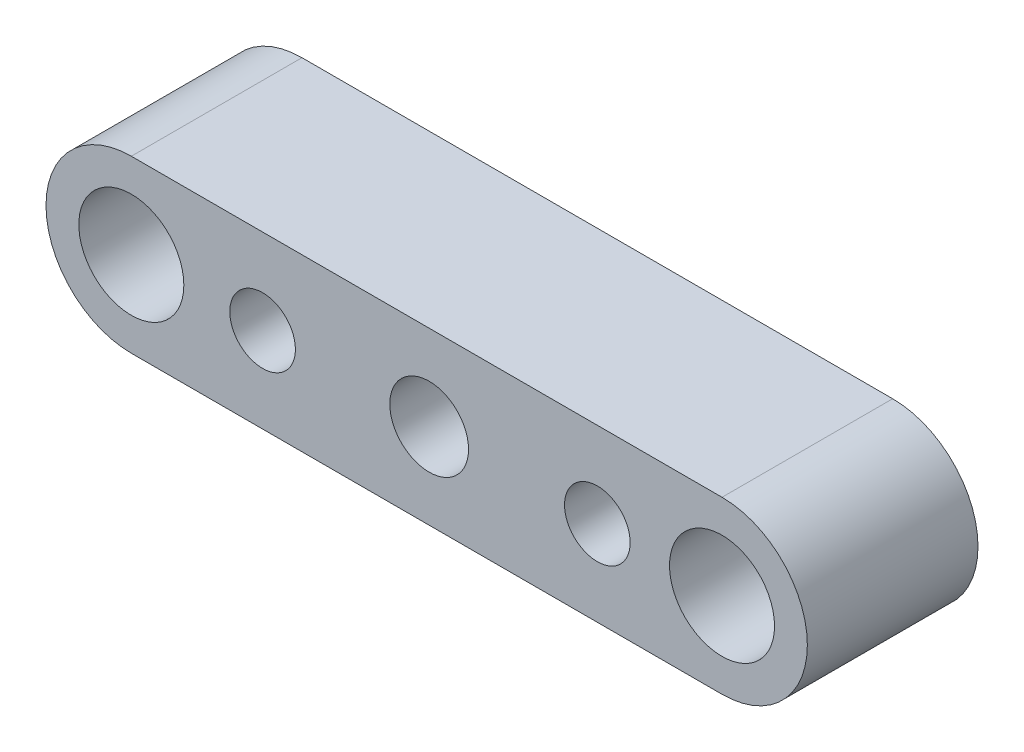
ISO-10303-21;
HEADER;
FILE_DESCRIPTION(('STEP AP214'),'2;1');
FILE_NAME('part.step','',(''),(''),'','','');
FILE_SCHEMA(('AUTOMOTIVE_DESIGN { 1 0 10303 214 1 1 1 1 }'));
ENDSEC;
DATA;
#1=APPLICATION_CONTEXT('core data for automotive mechanical design processes');
#2=APPLICATION_PROTOCOL_DEFINITION('international standard','automotive_design',2000,#1);
#3=PRODUCT_CONTEXT('',#1,'mechanical');
#4=PRODUCT('Part','Part','',(#3));
#5=PRODUCT_RELATED_PRODUCT_CATEGORY('part','',(#4));
#6=PRODUCT_DEFINITION_FORMATION('','',#4);
#7=PRODUCT_DEFINITION_CONTEXT('part definition',#1,'design');
#8=PRODUCT_DEFINITION('design','',#6,#7);
#9=PRODUCT_DEFINITION_SHAPE('','',#8);
#10=(LENGTH_UNIT() NAMED_UNIT(*) SI_UNIT(.MILLI.,.METRE.));
#11=(NAMED_UNIT(*) PLANE_ANGLE_UNIT() SI_UNIT($,.RADIAN.));
#12=(NAMED_UNIT(*) SI_UNIT($,.STERADIAN.) SOLID_ANGLE_UNIT());
#13=UNCERTAINTY_MEASURE_WITH_UNIT(LENGTH_MEASURE(1.E-05),#10,'distance_accuracy_value','');
#14=(GEOMETRIC_REPRESENTATION_CONTEXT(3) GLOBAL_UNCERTAINTY_ASSIGNED_CONTEXT((#13)) GLOBAL_UNIT_ASSIGNED_CONTEXT((#10,
#11,#12)) REPRESENTATION_CONTEXT('',''));
#15=CARTESIAN_POINT('',(0.,0.,0.));
#16=DIRECTION('',(0.,0.,1.));
#17=DIRECTION('',(1.,0.,0.));
#18=AXIS2_PLACEMENT_3D('',#15,#16,#17);
#19=CARTESIAN_POINT('',(0.,0.,13.));
#20=DIRECTION('',(0.,0.,-1.));
#21=DIRECTION('',(-1.,0.,0.));
#22=AXIS2_PLACEMENT_3D('',#19,#20,#21);
#23=CYLINDRICAL_SURFACE('',#22,6.5);
#24=CARTESIAN_POINT('',(0.,0.,0.));
#25=DIRECTION('',(0.,0.,1.));
#26=DIRECTION('',(1.,0.,0.));
#27=AXIS2_PLACEMENT_3D('',#24,#25,#26);
#28=CIRCLE('',#27,6.5);
#29=CARTESIAN_POINT('',(0.,6.5,0.));
#30=VERTEX_POINT('',#29);
#31=CARTESIAN_POINT('',(0.,-6.5,0.));
#32=VERTEX_POINT('',#31);
#33=EDGE_CURVE('E97',#30,#32,#28,.T.);
#34=ORIENTED_EDGE('',*,*,#33,.T.);
#35=DIRECTION('',(0.,0.,-1.));
#36=VECTOR('',#35,1.);
#37=CARTESIAN_POINT('',(0.,-6.5,13.));
#38=LINE('',#37,#36);
#39=CARTESIAN_POINT('',(0.,-6.5,13.));
#40=VERTEX_POINT('',#39);
#41=EDGE_CURVE('E11',#40,#32,#38,.T.);
#42=ORIENTED_EDGE('',*,*,#41,.F.);
#43=CARTESIAN_POINT('',(0.,0.,13.));
#44=DIRECTION('',(0.,0.,1.));
#45=DIRECTION('',(1.,0.,0.));
#46=AXIS2_PLACEMENT_3D('',#43,#44,#45);
#47=CIRCLE('',#46,6.5);
#48=CARTESIAN_POINT('',(0.,6.5,13.));
#49=VERTEX_POINT('',#48);
#50=EDGE_CURVE('E85',#49,#40,#47,.T.);
#51=ORIENTED_EDGE('',*,*,#50,.F.);
#52=DIRECTION('',(0.,0.,-1.));
#53=VECTOR('',#52,1.);
#54=CARTESIAN_POINT('',(0.,6.5,13.));
#55=LINE('',#54,#53);
#56=EDGE_CURVE('E93',#49,#30,#55,.T.);
#57=ORIENTED_EDGE('',*,*,#56,.T.);
#58=EDGE_LOOP('',(#34,#42,#51,#57));
#59=FACE_BOUND('',#58,.T.);
#60=ADVANCED_FACE('F34',(#59),#23,.T.);
#61=CARTESIAN_POINT('',(0.,-6.5,13.));
#62=DIRECTION('',(0.,1.,0.));
#63=DIRECTION('',(0.,0.,1.));
#64=AXIS2_PLACEMENT_3D('',#61,#62,#63);
#65=PLANE('',#64);
#66=DIRECTION('',(1.,0.,0.));
#67=VECTOR('',#66,1.);
#68=CARTESIAN_POINT('',(0.,-6.5,0.));
#69=LINE('',#68,#67);
#70=CARTESIAN_POINT('',(45.,-6.5,0.));
#71=VERTEX_POINT('',#70);
#72=EDGE_CURVE('E89',#32,#71,#69,.T.);
#73=ORIENTED_EDGE('',*,*,#72,.T.);
#74=DIRECTION('',(0.,0.,-1.));
#75=VECTOR('',#74,1.);
#76=CARTESIAN_POINT('',(45.,-6.5,13.));
#77=LINE('',#76,#75);
#78=CARTESIAN_POINT('',(45.,-6.5,13.));
#79=VERTEX_POINT('',#78);
#80=EDGE_CURVE('E42',#79,#71,#77,.T.);
#81=ORIENTED_EDGE('',*,*,#80,.F.);
#82=DIRECTION('',(1.,0.,0.));
#83=VECTOR('',#82,1.);
#84=CARTESIAN_POINT('',(0.,-6.5,13.));
#85=LINE('',#84,#83);
#86=EDGE_CURVE('E80',#40,#79,#85,.T.);
#87=ORIENTED_EDGE('',*,*,#86,.F.);
#88=ORIENTED_EDGE('',*,*,#41,.T.);
#89=EDGE_LOOP('',(#73,#81,#87,#88));
#90=FACE_BOUND('',#89,.T.);
#91=ADVANCED_FACE('F88',(#90),#65,.F.);
#92=CARTESIAN_POINT('',(45.,0.,13.));
#93=DIRECTION('',(0.,0.,-1.));
#94=DIRECTION('',(-1.,0.,0.));
#95=AXIS2_PLACEMENT_3D('',#92,#93,#94);
#96=CYLINDRICAL_SURFACE('',#95,6.5);
#97=CARTESIAN_POINT('',(45.,0.,0.));
#98=DIRECTION('',(0.,0.,1.));
#99=DIRECTION('',(1.,0.,0.));
#100=AXIS2_PLACEMENT_3D('',#97,#98,#99);
#101=CIRCLE('',#100,6.5);
#102=CARTESIAN_POINT('',(45.,6.5,0.));
#103=VERTEX_POINT('',#102);
#104=EDGE_CURVE('E67',#71,#103,#101,.T.);
#105=ORIENTED_EDGE('',*,*,#104,.T.);
#106=DIRECTION('',(0.,0.,-1.));
#107=VECTOR('',#106,1.);
#108=CARTESIAN_POINT('',(45.,6.5,13.));
#109=LINE('',#108,#107);
#110=CARTESIAN_POINT('',(45.,6.5,13.));
#111=VERTEX_POINT('',#110);
#112=EDGE_CURVE('E90',#111,#103,#109,.T.);
#113=ORIENTED_EDGE('',*,*,#112,.F.);
#114=CARTESIAN_POINT('',(45.,0.,13.));
#115=DIRECTION('',(0.,0.,1.));
#116=DIRECTION('',(1.,0.,0.));
#117=AXIS2_PLACEMENT_3D('',#114,#115,#116);
#118=CIRCLE('',#117,6.5);
#119=EDGE_CURVE('E83',#79,#111,#118,.T.);
#120=ORIENTED_EDGE('',*,*,#119,.F.);
#121=ORIENTED_EDGE('',*,*,#80,.T.);
#122=EDGE_LOOP('',(#105,#113,#120,#121));
#123=FACE_BOUND('',#122,.T.);
#124=ADVANCED_FACE('F91',(#123),#96,.T.);
#125=CARTESIAN_POINT('',(0.,6.5,13.));
#126=DIRECTION('',(0.,-1.,0.));
#127=DIRECTION('',(0.,0.,-1.));
#128=AXIS2_PLACEMENT_3D('',#125,#126,#127);
#129=PLANE('',#128);
#130=DIRECTION('',(-1.,0.,0.));
#131=VECTOR('',#130,1.);
#132=CARTESIAN_POINT('',(0.,6.5,0.));
#133=LINE('',#132,#131);
#134=EDGE_CURVE('E73',#103,#30,#133,.T.);
#135=ORIENTED_EDGE('',*,*,#134,.T.);
#136=ORIENTED_EDGE('',*,*,#56,.F.);
#137=DIRECTION('',(-1.,0.,0.));
#138=VECTOR('',#137,1.);
#139=CARTESIAN_POINT('',(0.,6.5,13.));
#140=LINE('',#139,#138);
#141=EDGE_CURVE('E50',#111,#49,#140,.T.);
#142=ORIENTED_EDGE('',*,*,#141,.F.);
#143=ORIENTED_EDGE('',*,*,#112,.T.);
#144=EDGE_LOOP('',(#135,#136,#142,#143));
#145=FACE_BOUND('',#144,.T.);
#146=ADVANCED_FACE('F105',(#145),#129,.F.);
#147=CARTESIAN_POINT('',(0.,0.,13.));
#148=DIRECTION('',(0.,0.,1.));
#149=DIRECTION('',(1.,0.,0.));
#150=AXIS2_PLACEMENT_3D('',#147,#148,#149);
#151=PLANE('',#150);
#152=CARTESIAN_POINT('',(0.,0.,13.));
#153=DIRECTION('',(0.,0.,1.));
#154=DIRECTION('',(1.,0.,0.));
#155=AXIS2_PLACEMENT_3D('',#152,#153,#154);
#156=CIRCLE('',#155,4.);
#157=CARTESIAN_POINT('',(4.,0.,13.));
#158=VERTEX_POINT('',#157);
#159=EDGE_CURVE('E135',#158,#158,#156,.T.);
#160=ORIENTED_EDGE('',*,*,#159,.F.);
#161=EDGE_LOOP('',(#160));
#162=FACE_BOUND('',#161,.T.);
#163=CARTESIAN_POINT('',(45.,0.,13.));
#164=DIRECTION('',(0.,0.,1.));
#165=DIRECTION('',(1.,0.,0.));
#166=AXIS2_PLACEMENT_3D('',#163,#164,#165);
#167=CIRCLE('',#166,4.);
#168=CARTESIAN_POINT('',(49.,0.,13.));
#169=VERTEX_POINT('',#168);
#170=EDGE_CURVE('E129',#169,#169,#167,.T.);
#171=ORIENTED_EDGE('',*,*,#170,.F.);
#172=EDGE_LOOP('',(#171));
#173=FACE_BOUND('',#172,.T.);
#174=CARTESIAN_POINT('',(10.,0.,13.));
#175=DIRECTION('',(0.,0.,1.));
#176=DIRECTION('',(1.,0.,0.));
#177=AXIS2_PLACEMENT_3D('',#174,#175,#176);
#178=CIRCLE('',#177,2.5);
#179=CARTESIAN_POINT('',(12.5,0.,13.));
#180=VERTEX_POINT('',#179);
#181=EDGE_CURVE('E124',#180,#180,#178,.T.);
#182=ORIENTED_EDGE('',*,*,#181,.F.);
#183=EDGE_LOOP('',(#182));
#184=FACE_BOUND('',#183,.T.);
#185=CARTESIAN_POINT('',(35.5,0.,13.));
#186=DIRECTION('',(0.,0.,1.));
#187=DIRECTION('',(1.,0.,0.));
#188=AXIS2_PLACEMENT_3D('',#185,#186,#187);
#189=CIRCLE('',#188,2.5);
#190=CARTESIAN_POINT('',(38.,0.,13.));
#191=VERTEX_POINT('',#190);
#192=EDGE_CURVE('E118',#191,#191,#189,.T.);
#193=ORIENTED_EDGE('',*,*,#192,.F.);
#194=EDGE_LOOP('',(#193));
#195=FACE_BOUND('',#194,.T.);
#196=CARTESIAN_POINT('',(22.6890823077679,0.,13.));
#197=DIRECTION('',(0.,0.,1.));
#198=DIRECTION('',(1.,0.,0.));
#199=AXIS2_PLACEMENT_3D('',#196,#197,#198);
#200=CIRCLE('',#199,3.);
#201=CARTESIAN_POINT('',(25.6890823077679,0.,13.));
#202=VERTEX_POINT('',#201);
#203=EDGE_CURVE('E111',#202,#202,#200,.T.);
#204=ORIENTED_EDGE('',*,*,#203,.F.);
#205=EDGE_LOOP('',(#204));
#206=FACE_BOUND('',#205,.T.);
#207=ORIENTED_EDGE('',*,*,#50,.T.);
#208=ORIENTED_EDGE('',*,*,#86,.T.);
#209=ORIENTED_EDGE('',*,*,#119,.T.);
#210=ORIENTED_EDGE('',*,*,#141,.T.);
#211=EDGE_LOOP('',(#207,#208,#209,#210));
#212=FACE_BOUND('',#211,.T.);
#213=ADVANCED_FACE('F81',(#162,#173,#184,#195,#206,#212),#151,.T.);
#214=CARTESIAN_POINT('',(0.,0.,0.));
#215=DIRECTION('',(0.,0.,1.));
#216=DIRECTION('',(1.,0.,0.));
#217=AXIS2_PLACEMENT_3D('',#214,#215,#216);
#218=PLANE('',#217);
#219=CARTESIAN_POINT('',(0.,0.,0.));
#220=DIRECTION('',(0.,0.,1.));
#221=DIRECTION('',(1.,0.,0.));
#222=AXIS2_PLACEMENT_3D('',#219,#220,#221);
#223=CIRCLE('',#222,4.);
#224=CARTESIAN_POINT('',(4.,0.,0.));
#225=VERTEX_POINT('',#224);
#226=EDGE_CURVE('E115',#225,#225,#223,.T.);
#227=ORIENTED_EDGE('',*,*,#226,.T.);
#228=EDGE_LOOP('',(#227));
#229=FACE_BOUND('',#228,.T.);
#230=CARTESIAN_POINT('',(45.,0.,0.));
#231=DIRECTION('',(0.,0.,1.));
#232=DIRECTION('',(1.,0.,0.));
#233=AXIS2_PLACEMENT_3D('',#230,#231,#232);
#234=CIRCLE('',#233,4.);
#235=CARTESIAN_POINT('',(49.,0.,0.));
#236=VERTEX_POINT('',#235);
#237=EDGE_CURVE('E132',#236,#236,#234,.T.);
#238=ORIENTED_EDGE('',*,*,#237,.T.);
#239=EDGE_LOOP('',(#238));
#240=FACE_BOUND('',#239,.T.);
#241=CARTESIAN_POINT('',(10.,0.,0.));
#242=DIRECTION('',(0.,0.,1.));
#243=DIRECTION('',(1.,0.,0.));
#244=AXIS2_PLACEMENT_3D('',#241,#242,#243);
#245=CIRCLE('',#244,2.5);
#246=CARTESIAN_POINT('',(12.5,0.,0.));
#247=VERTEX_POINT('',#246);
#248=EDGE_CURVE('E100',#247,#247,#245,.T.);
#249=ORIENTED_EDGE('',*,*,#248,.T.);
#250=EDGE_LOOP('',(#249));
#251=FACE_BOUND('',#250,.T.);
#252=CARTESIAN_POINT('',(35.5,0.,0.));
#253=DIRECTION('',(0.,0.,1.));
#254=DIRECTION('',(1.,0.,0.));
#255=AXIS2_PLACEMENT_3D('',#252,#253,#254);
#256=CIRCLE('',#255,2.5);
#257=CARTESIAN_POINT('',(38.,0.,0.));
#258=VERTEX_POINT('',#257);
#259=EDGE_CURVE('E121',#258,#258,#256,.T.);
#260=ORIENTED_EDGE('',*,*,#259,.T.);
#261=EDGE_LOOP('',(#260));
#262=FACE_BOUND('',#261,.T.);
#263=CARTESIAN_POINT('',(22.6890823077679,0.,0.));
#264=DIRECTION('',(0.,0.,1.));
#265=DIRECTION('',(1.,0.,0.));
#266=AXIS2_PLACEMENT_3D('',#263,#264,#265);
#267=CIRCLE('',#266,3.);
#268=CARTESIAN_POINT('',(25.6890823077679,0.,0.));
#269=VERTEX_POINT('',#268);
#270=EDGE_CURVE('E114',#269,#269,#267,.T.);
#271=ORIENTED_EDGE('',*,*,#270,.T.);
#272=EDGE_LOOP('',(#271));
#273=FACE_BOUND('',#272,.T.);
#274=ORIENTED_EDGE('',*,*,#33,.F.);
#275=ORIENTED_EDGE('',*,*,#134,.F.);
#276=ORIENTED_EDGE('',*,*,#104,.F.);
#277=ORIENTED_EDGE('',*,*,#72,.F.);
#278=EDGE_LOOP('',(#274,#275,#276,#277));
#279=FACE_BOUND('',#278,.T.);
#280=ADVANCED_FACE('F108',(#229,#240,#251,#262,#273,#279),#218,.F.);
#281=CARTESIAN_POINT('',(22.6890823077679,0.,0.));
#282=DIRECTION('',(0.,0.,1.));
#283=DIRECTION('',(1.,0.,0.));
#284=AXIS2_PLACEMENT_3D('',#281,#282,#283);
#285=CYLINDRICAL_SURFACE('',#284,3.);
#286=CARTESIAN_POINT('',(25.6890823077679,0.,0.));
#287=CARTESIAN_POINT('',(25.6890823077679,0.,0.135416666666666));
#288=CARTESIAN_POINT('',(25.6890823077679,0.,0.270833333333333));
#289=CARTESIAN_POINT('',(25.6890823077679,0.,0.541666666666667));
#290=CARTESIAN_POINT('',(25.6890823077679,0.,0.677083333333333));
#291=CARTESIAN_POINT('',(25.6890823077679,0.,0.947916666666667));
#292=CARTESIAN_POINT('',(25.6890823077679,0.,1.08333333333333));
#293=CARTESIAN_POINT('',(25.6890823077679,0.,1.35416666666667));
#294=CARTESIAN_POINT('',(25.6890823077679,0.,1.48958333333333));
#295=CARTESIAN_POINT('',(25.6890823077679,0.,1.76041666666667));
#296=CARTESIAN_POINT('',(25.6890823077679,0.,1.89583333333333));
#297=CARTESIAN_POINT('',(25.6890823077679,0.,2.16666666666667));
#298=CARTESIAN_POINT('',(25.6890823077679,0.,2.30208333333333));
#299=CARTESIAN_POINT('',(25.6890823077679,0.,2.57291666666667));
#300=CARTESIAN_POINT('',(25.6890823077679,0.,2.70833333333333));
#301=CARTESIAN_POINT('',(25.6890823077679,0.,2.97916666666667));
#302=CARTESIAN_POINT('',(25.6890823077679,0.,3.11458333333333));
#303=CARTESIAN_POINT('',(25.6890823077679,0.,3.38541666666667));
#304=CARTESIAN_POINT('',(25.6890823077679,0.,3.52083333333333));
#305=CARTESIAN_POINT('',(25.6890823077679,0.,3.79166666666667));
#306=CARTESIAN_POINT('',(25.6890823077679,0.,3.92708333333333));
#307=CARTESIAN_POINT('',(25.6890823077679,0.,4.19791666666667));
#308=CARTESIAN_POINT('',(25.6890823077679,0.,4.33333333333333));
#309=CARTESIAN_POINT('',(25.6890823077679,0.,4.60416666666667));
#310=CARTESIAN_POINT('',(25.6890823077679,0.,4.73958333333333));
#311=CARTESIAN_POINT('',(25.6890823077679,0.,5.01041666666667));
#312=CARTESIAN_POINT('',(25.6890823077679,0.,5.14583333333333));
#313=CARTESIAN_POINT('',(25.6890823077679,0.,5.41666666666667));
#314=CARTESIAN_POINT('',(25.6890823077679,0.,5.55208333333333));
#315=CARTESIAN_POINT('',(25.6890823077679,0.,5.82291666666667));
#316=CARTESIAN_POINT('',(25.6890823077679,0.,5.95833333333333));
#317=CARTESIAN_POINT('',(25.6890823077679,0.,6.22916666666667));
#318=CARTESIAN_POINT('',(25.6890823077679,0.,6.36458333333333));
#319=CARTESIAN_POINT('',(25.6890823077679,0.,6.63541666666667));
#320=CARTESIAN_POINT('',(25.6890823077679,0.,6.77083333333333));
#321=CARTESIAN_POINT('',(25.6890823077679,0.,7.04166666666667));
#322=CARTESIAN_POINT('',(25.6890823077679,0.,7.17708333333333));
#323=CARTESIAN_POINT('',(25.6890823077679,0.,7.44791666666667));
#324=CARTESIAN_POINT('',(25.6890823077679,0.,7.58333333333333));
#325=CARTESIAN_POINT('',(25.6890823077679,0.,7.85416666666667));
#326=CARTESIAN_POINT('',(25.6890823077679,0.,7.98958333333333));
#327=CARTESIAN_POINT('',(25.6890823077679,0.,8.26041666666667));
#328=CARTESIAN_POINT('',(25.6890823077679,0.,8.39583333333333));
#329=CARTESIAN_POINT('',(25.6890823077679,0.,8.66666666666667));
#330=CARTESIAN_POINT('',(25.6890823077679,0.,8.80208333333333));
#331=CARTESIAN_POINT('',(25.6890823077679,0.,9.07291666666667));
#332=CARTESIAN_POINT('',(25.6890823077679,0.,9.20833333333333));
#333=CARTESIAN_POINT('',(25.6890823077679,0.,9.47916666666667));
#334=CARTESIAN_POINT('',(25.6890823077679,0.,9.61458333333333));
#335=CARTESIAN_POINT('',(25.6890823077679,0.,9.88541666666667));
#336=CARTESIAN_POINT('',(25.6890823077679,0.,10.0208333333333));
#337=CARTESIAN_POINT('',(25.6890823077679,0.,10.2916666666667));
#338=CARTESIAN_POINT('',(25.6890823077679,0.,10.4270833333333));
#339=CARTESIAN_POINT('',(25.6890823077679,0.,10.6979166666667));
#340=CARTESIAN_POINT('',(25.6890823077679,0.,10.8333333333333));
#341=CARTESIAN_POINT('',(25.6890823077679,0.,11.1041666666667));
#342=CARTESIAN_POINT('',(25.6890823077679,0.,11.2395833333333));
#343=CARTESIAN_POINT('',(25.6890823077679,0.,11.5104166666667));
#344=CARTESIAN_POINT('',(25.6890823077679,0.,11.6458333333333));
#345=CARTESIAN_POINT('',(25.6890823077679,0.,11.9166666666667));
#346=CARTESIAN_POINT('',(25.6890823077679,0.,12.0520833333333));
#347=CARTESIAN_POINT('',(25.6890823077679,0.,12.3229166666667));
#348=CARTESIAN_POINT('',(25.6890823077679,0.,12.4583333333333));
#349=CARTESIAN_POINT('',(25.6890823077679,0.,12.7291666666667));
#350=CARTESIAN_POINT('',(25.6890823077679,0.,12.8645833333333));
#351=CARTESIAN_POINT('',(25.6890823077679,0.,13.));
#352=B_SPLINE_CURVE_WITH_KNOTS('',3,(#286,#287,#288,#289,#290,#291,#292,#293,#294,#295,#296,
#297,#298,#299,#300,#301,#302,#303,#304,#305,#306,#307,#308,#309,#310,#311,#312,#313,#314,#315,
#316,#317,#318,#319,#320,#321,#322,#323,#324,#325,#326,#327,#328,#329,#330,#331,#332,#333,#334,
#335,#336,#337,#338,#339,#340,#341,#342,#343,#344,#345,#346,#347,#348,#349,#350,#351),
.UNSPECIFIED.,.F.,.F.,(4,2,2,2,2,2,2,2,2,2,2,2,2,2,2,2,2,2,2,2,2,2,2,2,2,2,2,2,2,2,2,2,4),(0.,
0.40625,0.8125,1.21875,1.625,2.03125,2.4375,2.84375,3.25,3.65625,4.0625,4.46875,4.875,5.28125,
5.6875,6.09375,6.5,6.90625,7.3125,7.71875,8.125,8.53125,8.9375,9.34375,9.75,10.15625,10.5625,
10.96875,11.375,11.78125,12.1875,12.59375,13.),.UNSPECIFIED.);
#353=EDGE_CURVE('BSEAM161',#269,#202,#352,.T.);
#354=ORIENTED_EDGE('',*,*,#270,.F.);
#355=ORIENTED_EDGE('',*,*,#203,.T.);
#356=ORIENTED_EDGE('',*,*,#353,.T.);
#357=ORIENTED_EDGE('',*,*,#353,.F.);
#358=EDGE_LOOP('',(#354,#356,#355,#357));
#359=FACE_BOUND('',#358,.T.);
#360=ADVANCED_FACE('F161',(#359),#285,.F.);
#361=CARTESIAN_POINT('',(35.5,0.,0.));
#362=DIRECTION('',(0.,0.,1.));
#363=DIRECTION('',(1.,0.,0.));
#364=AXIS2_PLACEMENT_3D('',#361,#362,#363);
#365=CYLINDRICAL_SURFACE('',#364,2.5);
#366=CARTESIAN_POINT('',(38.,0.,0.));
#367=CARTESIAN_POINT('',(38.,0.,0.135416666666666));
#368=CARTESIAN_POINT('',(38.,0.,0.270833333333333));
#369=CARTESIAN_POINT('',(38.,0.,0.541666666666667));
#370=CARTESIAN_POINT('',(38.,0.,0.677083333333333));
#371=CARTESIAN_POINT('',(38.,0.,0.947916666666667));
#372=CARTESIAN_POINT('',(38.,0.,1.08333333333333));
#373=CARTESIAN_POINT('',(38.,0.,1.35416666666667));
#374=CARTESIAN_POINT('',(38.,0.,1.48958333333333));
#375=CARTESIAN_POINT('',(38.,0.,1.76041666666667));
#376=CARTESIAN_POINT('',(38.,0.,1.89583333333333));
#377=CARTESIAN_POINT('',(38.,0.,2.16666666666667));
#378=CARTESIAN_POINT('',(38.,0.,2.30208333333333));
#379=CARTESIAN_POINT('',(38.,0.,2.57291666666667));
#380=CARTESIAN_POINT('',(38.,0.,2.70833333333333));
#381=CARTESIAN_POINT('',(38.,0.,2.97916666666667));
#382=CARTESIAN_POINT('',(38.,0.,3.11458333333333));
#383=CARTESIAN_POINT('',(38.,0.,3.38541666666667));
#384=CARTESIAN_POINT('',(38.,0.,3.52083333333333));
#385=CARTESIAN_POINT('',(38.,0.,3.79166666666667));
#386=CARTESIAN_POINT('',(38.,0.,3.92708333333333));
#387=CARTESIAN_POINT('',(38.,0.,4.19791666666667));
#388=CARTESIAN_POINT('',(38.,0.,4.33333333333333));
#389=CARTESIAN_POINT('',(38.,0.,4.60416666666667));
#390=CARTESIAN_POINT('',(38.,0.,4.73958333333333));
#391=CARTESIAN_POINT('',(38.,0.,5.01041666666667));
#392=CARTESIAN_POINT('',(38.,0.,5.14583333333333));
#393=CARTESIAN_POINT('',(38.,0.,5.41666666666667));
#394=CARTESIAN_POINT('',(38.,0.,5.55208333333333));
#395=CARTESIAN_POINT('',(38.,0.,5.82291666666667));
#396=CARTESIAN_POINT('',(38.,0.,5.95833333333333));
#397=CARTESIAN_POINT('',(38.,0.,6.22916666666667));
#398=CARTESIAN_POINT('',(38.,0.,6.36458333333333));
#399=CARTESIAN_POINT('',(38.,0.,6.63541666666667));
#400=CARTESIAN_POINT('',(38.,0.,6.77083333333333));
#401=CARTESIAN_POINT('',(38.,0.,7.04166666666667));
#402=CARTESIAN_POINT('',(38.,0.,7.17708333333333));
#403=CARTESIAN_POINT('',(38.,0.,7.44791666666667));
#404=CARTESIAN_POINT('',(38.,0.,7.58333333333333));
#405=CARTESIAN_POINT('',(38.,0.,7.85416666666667));
#406=CARTESIAN_POINT('',(38.,0.,7.98958333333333));
#407=CARTESIAN_POINT('',(38.,0.,8.26041666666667));
#408=CARTESIAN_POINT('',(38.,0.,8.39583333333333));
#409=CARTESIAN_POINT('',(38.,0.,8.66666666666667));
#410=CARTESIAN_POINT('',(38.,0.,8.80208333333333));
#411=CARTESIAN_POINT('',(38.,0.,9.07291666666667));
#412=CARTESIAN_POINT('',(38.,0.,9.20833333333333));
#413=CARTESIAN_POINT('',(38.,0.,9.47916666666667));
#414=CARTESIAN_POINT('',(38.,0.,9.61458333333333));
#415=CARTESIAN_POINT('',(38.,0.,9.88541666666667));
#416=CARTESIAN_POINT('',(38.,0.,10.0208333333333));
#417=CARTESIAN_POINT('',(38.,0.,10.2916666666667));
#418=CARTESIAN_POINT('',(38.,0.,10.4270833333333));
#419=CARTESIAN_POINT('',(38.,0.,10.6979166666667));
#420=CARTESIAN_POINT('',(38.,0.,10.8333333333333));
#421=CARTESIAN_POINT('',(38.,0.,11.1041666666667));
#422=CARTESIAN_POINT('',(38.,0.,11.2395833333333));
#423=CARTESIAN_POINT('',(38.,0.,11.5104166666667));
#424=CARTESIAN_POINT('',(38.,0.,11.6458333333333));
#425=CARTESIAN_POINT('',(38.,0.,11.9166666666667));
#426=CARTESIAN_POINT('',(38.,0.,12.0520833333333));
#427=CARTESIAN_POINT('',(38.,0.,12.3229166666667));
#428=CARTESIAN_POINT('',(38.,0.,12.4583333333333));
#429=CARTESIAN_POINT('',(38.,0.,12.7291666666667));
#430=CARTESIAN_POINT('',(38.,0.,12.8645833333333));
#431=CARTESIAN_POINT('',(38.,0.,13.));
#432=B_SPLINE_CURVE_WITH_KNOTS('',3,(#366,#367,#368,#369,#370,#371,#372,#373,#374,#375,#376,
#377,#378,#379,#380,#381,#382,#383,#384,#385,#386,#387,#388,#389,#390,#391,#392,#393,#394,#395,
#396,#397,#398,#399,#400,#401,#402,#403,#404,#405,#406,#407,#408,#409,#410,#411,#412,#413,#414,
#415,#416,#417,#418,#419,#420,#421,#422,#423,#424,#425,#426,#427,#428,#429,#430,#431),
.UNSPECIFIED.,.F.,.F.,(4,2,2,2,2,2,2,2,2,2,2,2,2,2,2,2,2,2,2,2,2,2,2,2,2,2,2,2,2,2,2,2,4),(0.,
0.40625,0.8125,1.21875,1.625,2.03125,2.4375,2.84375,3.25,3.65625,4.0625,4.46875,4.875,5.28125,
5.6875,6.09375,6.5,6.90625,7.3125,7.71875,8.125,8.53125,8.9375,9.34375,9.75,10.15625,10.5625,
10.96875,11.375,11.78125,12.1875,12.59375,13.),.UNSPECIFIED.);
#433=EDGE_CURVE('BSEAM163',#258,#191,#432,.T.);
#434=ORIENTED_EDGE('',*,*,#259,.F.);
#435=ORIENTED_EDGE('',*,*,#192,.T.);
#436=ORIENTED_EDGE('',*,*,#433,.T.);
#437=ORIENTED_EDGE('',*,*,#433,.F.);
#438=EDGE_LOOP('',(#434,#436,#435,#437));
#439=FACE_BOUND('',#438,.T.);
#440=ADVANCED_FACE('F163',(#439),#365,.F.);
#441=CARTESIAN_POINT('',(10.,0.,0.));
#442=DIRECTION('',(0.,0.,1.));
#443=DIRECTION('',(1.,0.,0.));
#444=AXIS2_PLACEMENT_3D('',#441,#442,#443);
#445=CYLINDRICAL_SURFACE('',#444,2.5);
#446=CARTESIAN_POINT('',(12.5,0.,0.));
#447=CARTESIAN_POINT('',(12.5,0.,0.135416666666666));
#448=CARTESIAN_POINT('',(12.5,0.,0.270833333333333));
#449=CARTESIAN_POINT('',(12.5,0.,0.541666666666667));
#450=CARTESIAN_POINT('',(12.5,0.,0.677083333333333));
#451=CARTESIAN_POINT('',(12.5,0.,0.947916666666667));
#452=CARTESIAN_POINT('',(12.5,0.,1.08333333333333));
#453=CARTESIAN_POINT('',(12.5,0.,1.35416666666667));
#454=CARTESIAN_POINT('',(12.5,0.,1.48958333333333));
#455=CARTESIAN_POINT('',(12.5,0.,1.76041666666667));
#456=CARTESIAN_POINT('',(12.5,0.,1.89583333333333));
#457=CARTESIAN_POINT('',(12.5,0.,2.16666666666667));
#458=CARTESIAN_POINT('',(12.5,0.,2.30208333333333));
#459=CARTESIAN_POINT('',(12.5,0.,2.57291666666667));
#460=CARTESIAN_POINT('',(12.5,0.,2.70833333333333));
#461=CARTESIAN_POINT('',(12.5,0.,2.97916666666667));
#462=CARTESIAN_POINT('',(12.5,0.,3.11458333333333));
#463=CARTESIAN_POINT('',(12.5,0.,3.38541666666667));
#464=CARTESIAN_POINT('',(12.5,0.,3.52083333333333));
#465=CARTESIAN_POINT('',(12.5,0.,3.79166666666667));
#466=CARTESIAN_POINT('',(12.5,0.,3.92708333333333));
#467=CARTESIAN_POINT('',(12.5,0.,4.19791666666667));
#468=CARTESIAN_POINT('',(12.5,0.,4.33333333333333));
#469=CARTESIAN_POINT('',(12.5,0.,4.60416666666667));
#470=CARTESIAN_POINT('',(12.5,0.,4.73958333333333));
#471=CARTESIAN_POINT('',(12.5,0.,5.01041666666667));
#472=CARTESIAN_POINT('',(12.5,0.,5.14583333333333));
#473=CARTESIAN_POINT('',(12.5,0.,5.41666666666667));
#474=CARTESIAN_POINT('',(12.5,0.,5.55208333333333));
#475=CARTESIAN_POINT('',(12.5,0.,5.82291666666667));
#476=CARTESIAN_POINT('',(12.5,0.,5.95833333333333));
#477=CARTESIAN_POINT('',(12.5,0.,6.22916666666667));
#478=CARTESIAN_POINT('',(12.5,0.,6.36458333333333));
#479=CARTESIAN_POINT('',(12.5,0.,6.63541666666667));
#480=CARTESIAN_POINT('',(12.5,0.,6.77083333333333));
#481=CARTESIAN_POINT('',(12.5,0.,7.04166666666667));
#482=CARTESIAN_POINT('',(12.5,0.,7.17708333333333));
#483=CARTESIAN_POINT('',(12.5,0.,7.44791666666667));
#484=CARTESIAN_POINT('',(12.5,0.,7.58333333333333));
#485=CARTESIAN_POINT('',(12.5,0.,7.85416666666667));
#486=CARTESIAN_POINT('',(12.5,0.,7.98958333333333));
#487=CARTESIAN_POINT('',(12.5,0.,8.26041666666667));
#488=CARTESIAN_POINT('',(12.5,0.,8.39583333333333));
#489=CARTESIAN_POINT('',(12.5,0.,8.66666666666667));
#490=CARTESIAN_POINT('',(12.5,0.,8.80208333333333));
#491=CARTESIAN_POINT('',(12.5,0.,9.07291666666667));
#492=CARTESIAN_POINT('',(12.5,0.,9.20833333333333));
#493=CARTESIAN_POINT('',(12.5,0.,9.47916666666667));
#494=CARTESIAN_POINT('',(12.5,0.,9.61458333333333));
#495=CARTESIAN_POINT('',(12.5,0.,9.88541666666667));
#496=CARTESIAN_POINT('',(12.5,0.,10.0208333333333));
#497=CARTESIAN_POINT('',(12.5,0.,10.2916666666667));
#498=CARTESIAN_POINT('',(12.5,0.,10.4270833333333));
#499=CARTESIAN_POINT('',(12.5,0.,10.6979166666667));
#500=CARTESIAN_POINT('',(12.5,0.,10.8333333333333));
#501=CARTESIAN_POINT('',(12.5,0.,11.1041666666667));
#502=CARTESIAN_POINT('',(12.5,0.,11.2395833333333));
#503=CARTESIAN_POINT('',(12.5,0.,11.5104166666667));
#504=CARTESIAN_POINT('',(12.5,0.,11.6458333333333));
#505=CARTESIAN_POINT('',(12.5,0.,11.9166666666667));
#506=CARTESIAN_POINT('',(12.5,0.,12.0520833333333));
#507=CARTESIAN_POINT('',(12.5,0.,12.3229166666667));
#508=CARTESIAN_POINT('',(12.5,0.,12.4583333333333));
#509=CARTESIAN_POINT('',(12.5,0.,12.7291666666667));
#510=CARTESIAN_POINT('',(12.5,0.,12.8645833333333));
#511=CARTESIAN_POINT('',(12.5,0.,13.));
#512=B_SPLINE_CURVE_WITH_KNOTS('',3,(#446,#447,#448,#449,#450,#451,#452,#453,#454,#455,#456,
#457,#458,#459,#460,#461,#462,#463,#464,#465,#466,#467,#468,#469,#470,#471,#472,#473,#474,#475,
#476,#477,#478,#479,#480,#481,#482,#483,#484,#485,#486,#487,#488,#489,#490,#491,#492,#493,#494,
#495,#496,#497,#498,#499,#500,#501,#502,#503,#504,#505,#506,#507,#508,#509,#510,#511),
.UNSPECIFIED.,.F.,.F.,(4,2,2,2,2,2,2,2,2,2,2,2,2,2,2,2,2,2,2,2,2,2,2,2,2,2,2,2,2,2,2,2,4),(0.,
0.40625,0.8125,1.21875,1.625,2.03125,2.4375,2.84375,3.25,3.65625,4.0625,4.46875,4.875,5.28125,
5.6875,6.09375,6.5,6.90625,7.3125,7.71875,8.125,8.53125,8.9375,9.34375,9.75,10.15625,10.5625,
10.96875,11.375,11.78125,12.1875,12.59375,13.),.UNSPECIFIED.);
#513=EDGE_CURVE('BSEAM170',#247,#180,#512,.T.);
#514=ORIENTED_EDGE('',*,*,#248,.F.);
#515=ORIENTED_EDGE('',*,*,#181,.T.);
#516=ORIENTED_EDGE('',*,*,#513,.T.);
#517=ORIENTED_EDGE('',*,*,#513,.F.);
#518=EDGE_LOOP('',(#514,#516,#515,#517));
#519=FACE_BOUND('',#518,.T.);
#520=ADVANCED_FACE('F170',(#519),#445,.F.);
#521=CARTESIAN_POINT('',(45.,0.,0.));
#522=DIRECTION('',(0.,0.,1.));
#523=DIRECTION('',(1.,0.,0.));
#524=AXIS2_PLACEMENT_3D('',#521,#522,#523);
#525=CYLINDRICAL_SURFACE('',#524,4.);
#526=CARTESIAN_POINT('',(49.,0.,0.));
#527=CARTESIAN_POINT('',(49.,0.,0.135416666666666));
#528=CARTESIAN_POINT('',(49.,0.,0.270833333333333));
#529=CARTESIAN_POINT('',(49.,0.,0.541666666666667));
#530=CARTESIAN_POINT('',(49.,0.,0.677083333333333));
#531=CARTESIAN_POINT('',(49.,0.,0.947916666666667));
#532=CARTESIAN_POINT('',(49.,0.,1.08333333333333));
#533=CARTESIAN_POINT('',(49.,0.,1.35416666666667));
#534=CARTESIAN_POINT('',(49.,0.,1.48958333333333));
#535=CARTESIAN_POINT('',(49.,0.,1.76041666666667));
#536=CARTESIAN_POINT('',(49.,0.,1.89583333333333));
#537=CARTESIAN_POINT('',(49.,0.,2.16666666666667));
#538=CARTESIAN_POINT('',(49.,0.,2.30208333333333));
#539=CARTESIAN_POINT('',(49.,0.,2.57291666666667));
#540=CARTESIAN_POINT('',(49.,0.,2.70833333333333));
#541=CARTESIAN_POINT('',(49.,0.,2.97916666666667));
#542=CARTESIAN_POINT('',(49.,0.,3.11458333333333));
#543=CARTESIAN_POINT('',(49.,0.,3.38541666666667));
#544=CARTESIAN_POINT('',(49.,0.,3.52083333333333));
#545=CARTESIAN_POINT('',(49.,0.,3.79166666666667));
#546=CARTESIAN_POINT('',(49.,0.,3.92708333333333));
#547=CARTESIAN_POINT('',(49.,0.,4.19791666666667));
#548=CARTESIAN_POINT('',(49.,0.,4.33333333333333));
#549=CARTESIAN_POINT('',(49.,0.,4.60416666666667));
#550=CARTESIAN_POINT('',(49.,0.,4.73958333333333));
#551=CARTESIAN_POINT('',(49.,0.,5.01041666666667));
#552=CARTESIAN_POINT('',(49.,0.,5.14583333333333));
#553=CARTESIAN_POINT('',(49.,0.,5.41666666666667));
#554=CARTESIAN_POINT('',(49.,0.,5.55208333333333));
#555=CARTESIAN_POINT('',(49.,0.,5.82291666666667));
#556=CARTESIAN_POINT('',(49.,0.,5.95833333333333));
#557=CARTESIAN_POINT('',(49.,0.,6.22916666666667));
#558=CARTESIAN_POINT('',(49.,0.,6.36458333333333));
#559=CARTESIAN_POINT('',(49.,0.,6.63541666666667));
#560=CARTESIAN_POINT('',(49.,0.,6.77083333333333));
#561=CARTESIAN_POINT('',(49.,0.,7.04166666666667));
#562=CARTESIAN_POINT('',(49.,0.,7.17708333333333));
#563=CARTESIAN_POINT('',(49.,0.,7.44791666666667));
#564=CARTESIAN_POINT('',(49.,0.,7.58333333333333));
#565=CARTESIAN_POINT('',(49.,0.,7.85416666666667));
#566=CARTESIAN_POINT('',(49.,0.,7.98958333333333));
#567=CARTESIAN_POINT('',(49.,0.,8.26041666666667));
#568=CARTESIAN_POINT('',(49.,0.,8.39583333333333));
#569=CARTESIAN_POINT('',(49.,0.,8.66666666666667));
#570=CARTESIAN_POINT('',(49.,0.,8.80208333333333));
#571=CARTESIAN_POINT('',(49.,0.,9.07291666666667));
#572=CARTESIAN_POINT('',(49.,0.,9.20833333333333));
#573=CARTESIAN_POINT('',(49.,0.,9.47916666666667));
#574=CARTESIAN_POINT('',(49.,0.,9.61458333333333));
#575=CARTESIAN_POINT('',(49.,0.,9.88541666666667));
#576=CARTESIAN_POINT('',(49.,0.,10.0208333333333));
#577=CARTESIAN_POINT('',(49.,0.,10.2916666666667));
#578=CARTESIAN_POINT('',(49.,0.,10.4270833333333));
#579=CARTESIAN_POINT('',(49.,0.,10.6979166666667));
#580=CARTESIAN_POINT('',(49.,0.,10.8333333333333));
#581=CARTESIAN_POINT('',(49.,0.,11.1041666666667));
#582=CARTESIAN_POINT('',(49.,0.,11.2395833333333));
#583=CARTESIAN_POINT('',(49.,0.,11.5104166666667));
#584=CARTESIAN_POINT('',(49.,0.,11.6458333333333));
#585=CARTESIAN_POINT('',(49.,0.,11.9166666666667));
#586=CARTESIAN_POINT('',(49.,0.,12.0520833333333));
#587=CARTESIAN_POINT('',(49.,0.,12.3229166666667));
#588=CARTESIAN_POINT('',(49.,0.,12.4583333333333));
#589=CARTESIAN_POINT('',(49.,0.,12.7291666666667));
#590=CARTESIAN_POINT('',(49.,0.,12.8645833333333));
#591=CARTESIAN_POINT('',(49.,0.,13.));
#592=B_SPLINE_CURVE_WITH_KNOTS('',3,(#526,#527,#528,#529,#530,#531,#532,#533,#534,#535,#536,
#537,#538,#539,#540,#541,#542,#543,#544,#545,#546,#547,#548,#549,#550,#551,#552,#553,#554,#555,
#556,#557,#558,#559,#560,#561,#562,#563,#564,#565,#566,#567,#568,#569,#570,#571,#572,#573,#574,
#575,#576,#577,#578,#579,#580,#581,#582,#583,#584,#585,#586,#587,#588,#589,#590,#591),
.UNSPECIFIED.,.F.,.F.,(4,2,2,2,2,2,2,2,2,2,2,2,2,2,2,2,2,2,2,2,2,2,2,2,2,2,2,2,2,2,2,2,4),(0.,
0.40625,0.8125,1.21875,1.625,2.03125,2.4375,2.84375,3.25,3.65625,4.0625,4.46875,4.875,5.28125,
5.6875,6.09375,6.5,6.90625,7.3125,7.71875,8.125,8.53125,8.9375,9.34375,9.75,10.15625,10.5625,
10.96875,11.375,11.78125,12.1875,12.59375,13.),.UNSPECIFIED.);
#593=EDGE_CURVE('BSEAM146',#236,#169,#592,.T.);
#594=ORIENTED_EDGE('',*,*,#237,.F.);
#595=ORIENTED_EDGE('',*,*,#170,.T.);
#596=ORIENTED_EDGE('',*,*,#593,.T.);
#597=ORIENTED_EDGE('',*,*,#593,.F.);
#598=EDGE_LOOP('',(#594,#596,#595,#597));
#599=FACE_BOUND('',#598,.T.);
#600=ADVANCED_FACE('F146',(#599),#525,.F.);
#601=CARTESIAN_POINT('',(0.,0.,0.));
#602=DIRECTION('',(0.,0.,1.));
#603=DIRECTION('',(1.,0.,0.));
#604=AXIS2_PLACEMENT_3D('',#601,#602,#603);
#605=CYLINDRICAL_SURFACE('',#604,4.);
#606=CARTESIAN_POINT('',(4.,0.,0.));
#607=CARTESIAN_POINT('',(4.,0.,0.135416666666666));
#608=CARTESIAN_POINT('',(4.,0.,0.270833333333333));
#609=CARTESIAN_POINT('',(4.,0.,0.541666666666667));
#610=CARTESIAN_POINT('',(4.,0.,0.677083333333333));
#611=CARTESIAN_POINT('',(4.,0.,0.947916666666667));
#612=CARTESIAN_POINT('',(4.,0.,1.08333333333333));
#613=CARTESIAN_POINT('',(4.,0.,1.35416666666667));
#614=CARTESIAN_POINT('',(4.,0.,1.48958333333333));
#615=CARTESIAN_POINT('',(4.,0.,1.76041666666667));
#616=CARTESIAN_POINT('',(4.,0.,1.89583333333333));
#617=CARTESIAN_POINT('',(4.,0.,2.16666666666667));
#618=CARTESIAN_POINT('',(4.,0.,2.30208333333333));
#619=CARTESIAN_POINT('',(4.,0.,2.57291666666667));
#620=CARTESIAN_POINT('',(4.,0.,2.70833333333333));
#621=CARTESIAN_POINT('',(4.,0.,2.97916666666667));
#622=CARTESIAN_POINT('',(4.,0.,3.11458333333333));
#623=CARTESIAN_POINT('',(4.,0.,3.38541666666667));
#624=CARTESIAN_POINT('',(4.,0.,3.52083333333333));
#625=CARTESIAN_POINT('',(4.,0.,3.79166666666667));
#626=CARTESIAN_POINT('',(4.,0.,3.92708333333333));
#627=CARTESIAN_POINT('',(4.,0.,4.19791666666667));
#628=CARTESIAN_POINT('',(4.,0.,4.33333333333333));
#629=CARTESIAN_POINT('',(4.,0.,4.60416666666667));
#630=CARTESIAN_POINT('',(4.,0.,4.73958333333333));
#631=CARTESIAN_POINT('',(4.,0.,5.01041666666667));
#632=CARTESIAN_POINT('',(4.,0.,5.14583333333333));
#633=CARTESIAN_POINT('',(4.,0.,5.41666666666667));
#634=CARTESIAN_POINT('',(4.,0.,5.55208333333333));
#635=CARTESIAN_POINT('',(4.,0.,5.82291666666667));
#636=CARTESIAN_POINT('',(4.,0.,5.95833333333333));
#637=CARTESIAN_POINT('',(4.,0.,6.22916666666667));
#638=CARTESIAN_POINT('',(4.,0.,6.36458333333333));
#639=CARTESIAN_POINT('',(4.,0.,6.63541666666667));
#640=CARTESIAN_POINT('',(4.,0.,6.77083333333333));
#641=CARTESIAN_POINT('',(4.,0.,7.04166666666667));
#642=CARTESIAN_POINT('',(4.,0.,7.17708333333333));
#643=CARTESIAN_POINT('',(4.,0.,7.44791666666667));
#644=CARTESIAN_POINT('',(4.,0.,7.58333333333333));
#645=CARTESIAN_POINT('',(4.,0.,7.85416666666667));
#646=CARTESIAN_POINT('',(4.,0.,7.98958333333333));
#647=CARTESIAN_POINT('',(4.,0.,8.26041666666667));
#648=CARTESIAN_POINT('',(4.,0.,8.39583333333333));
#649=CARTESIAN_POINT('',(4.,0.,8.66666666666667));
#650=CARTESIAN_POINT('',(4.,0.,8.80208333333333));
#651=CARTESIAN_POINT('',(4.,0.,9.07291666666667));
#652=CARTESIAN_POINT('',(4.,0.,9.20833333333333));
#653=CARTESIAN_POINT('',(4.,0.,9.47916666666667));
#654=CARTESIAN_POINT('',(4.,0.,9.61458333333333));
#655=CARTESIAN_POINT('',(4.,0.,9.88541666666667));
#656=CARTESIAN_POINT('',(4.,0.,10.0208333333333));
#657=CARTESIAN_POINT('',(4.,0.,10.2916666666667));
#658=CARTESIAN_POINT('',(4.,0.,10.4270833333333));
#659=CARTESIAN_POINT('',(4.,0.,10.6979166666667));
#660=CARTESIAN_POINT('',(4.,0.,10.8333333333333));
#661=CARTESIAN_POINT('',(4.,0.,11.1041666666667));
#662=CARTESIAN_POINT('',(4.,0.,11.2395833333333));
#663=CARTESIAN_POINT('',(4.,0.,11.5104166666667));
#664=CARTESIAN_POINT('',(4.,0.,11.6458333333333));
#665=CARTESIAN_POINT('',(4.,0.,11.9166666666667));
#666=CARTESIAN_POINT('',(4.,0.,12.0520833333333));
#667=CARTESIAN_POINT('',(4.,0.,12.3229166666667));
#668=CARTESIAN_POINT('',(4.,0.,12.4583333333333));
#669=CARTESIAN_POINT('',(4.,0.,12.7291666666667));
#670=CARTESIAN_POINT('',(4.,0.,12.8645833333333));
#671=CARTESIAN_POINT('',(4.,0.,13.));
#672=B_SPLINE_CURVE_WITH_KNOTS('',3,(#606,#607,#608,#609,#610,#611,#612,#613,#614,#615,#616,
#617,#618,#619,#620,#621,#622,#623,#624,#625,#626,#627,#628,#629,#630,#631,#632,#633,#634,#635,
#636,#637,#638,#639,#640,#641,#642,#643,#644,#645,#646,#647,#648,#649,#650,#651,#652,#653,#654,
#655,#656,#657,#658,#659,#660,#661,#662,#663,#664,#665,#666,#667,#668,#669,#670,#671),
.UNSPECIFIED.,.F.,.F.,(4,2,2,2,2,2,2,2,2,2,2,2,2,2,2,2,2,2,2,2,2,2,2,2,2,2,2,2,2,2,2,2,4),(0.,
0.40625,0.8125,1.21875,1.625,2.03125,2.4375,2.84375,3.25,3.65625,4.0625,4.46875,4.875,5.28125,
5.6875,6.09375,6.5,6.90625,7.3125,7.71875,8.125,8.53125,8.9375,9.34375,9.75,10.15625,10.5625,
10.96875,11.375,11.78125,12.1875,12.59375,13.),.UNSPECIFIED.);
#673=EDGE_CURVE('BSEAM143',#225,#158,#672,.T.);
#674=ORIENTED_EDGE('',*,*,#226,.F.);
#675=ORIENTED_EDGE('',*,*,#159,.T.);
#676=ORIENTED_EDGE('',*,*,#673,.T.);
#677=ORIENTED_EDGE('',*,*,#673,.F.);
#678=EDGE_LOOP('',(#674,#676,#675,#677));
#679=FACE_BOUND('',#678,.T.);
#680=ADVANCED_FACE('F143',(#679),#605,.F.);
#681=CLOSED_SHELL('',(#60,#91,#124,#146,#213,#280,#360,#440,#520,#600,#680));
#682=MANIFOLD_SOLID_BREP('B2',#681);
#683=ADVANCED_BREP_SHAPE_REPRESENTATION('',(#18,#682),#14);
#684=SHAPE_DEFINITION_REPRESENTATION(#9,#683);
ENDSEC;
END-ISO-10303-21;
